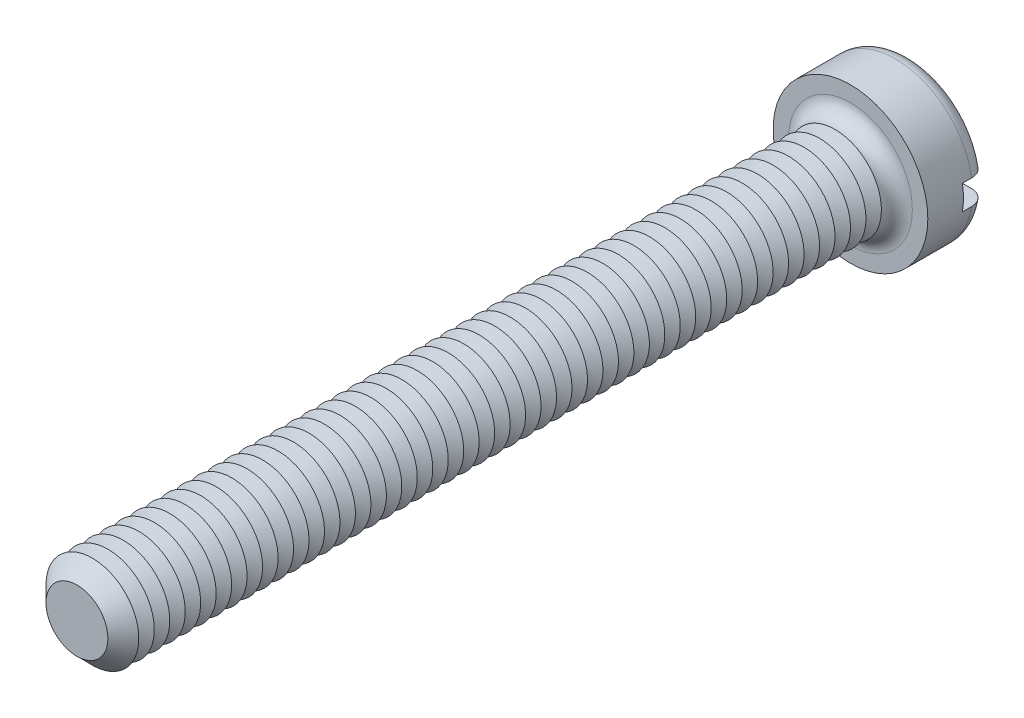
from build123d import *

# Parameters (mm, degrees)
SKETCH3_R           = 5
BOSS_EXTRUDE2_DEPTH = 3.9
SKETCH4_R           = 3
BOSS_EXTRUDE3_DEPTH = 50
FILLET1_R           = 1
CHAMFER1_SIZE       = 1
LPATTERN1_COUNT     = 48
LPATTERN1_PITCH     = 1
SKETCH8_W           = 10
SKETCH8_H           = 1.6
CUT_EXTRUDE1_DEPTH  = 1.6


with BuildPart() as part:
    # Sketch3 → Boss-Extrude2 (new body)
    with BuildSketch(Plane.XY):
        Circle(SKETCH3_R)
    extrude(amount=-BOSS_EXTRUDE2_DEPTH)

    # Sketch4 → Boss-Extrude3 (add)
    with BuildSketch(Plane.XY):
        Circle(SKETCH4_R)
    extrude(amount=BOSS_EXTRUDE3_DEPTH)

    # Fillet1
    fillet1_edges = [part.edges().sort_by_distance(p)[0] for p in [
        (-5, 0, -3.9),
        (-3, 0, 0),
    ]]
    fillet(fillet1_edges, radius=FILLET1_R)

    # Chamfer1
    chamfer1_edges = [part.edges().sort_by_distance(p)[0] for p in [
        (-3, 0, 50),
    ]]
    chamfer(chamfer1_edges, length=CHAMFER1_SIZE)

    # Sketch6 → Cut-Revolve1 (revolve, cut)
    with BuildSketch(Plane(origin=(0, 0, 0), x_dir=(0, 0, -1), z_dir=(1, 0, 0)), mode=Mode.PRIVATE) as cut_revolve1_sk:
        Polygon((-1, 3), (-1.5, 2.133974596), (-2, 3), align=None)
    cut_revolve1 = revolve(cut_revolve1_sk.sketch.rotate(Axis((0, 0, -1.694361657), (0, 0, 1)), 90), axis=Axis((0, 0, -1.694361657), (0, 0, 1)), mode=Mode.SUBTRACT)

    # LPattern1: Cut-Revolve1 ×48
    with Locations(*[(0, 0, i * LPATTERN1_PITCH) for i in range(1, LPATTERN1_COUNT)]):
        add(cut_revolve1, mode=Mode.SUBTRACT)

    # Sketch8 → Cut-Extrude1 (cut)
    with BuildSketch(Plane(origin=(0, 0, -3.9), x_dir=(-1, 0, 0), z_dir=(0, 0, -1))):
        Rectangle(SKETCH8_W, SKETCH8_H)
    extrude(amount=-CUT_EXTRUDE1_DEPTH, mode=Mode.SUBTRACT)


solid = part.part
